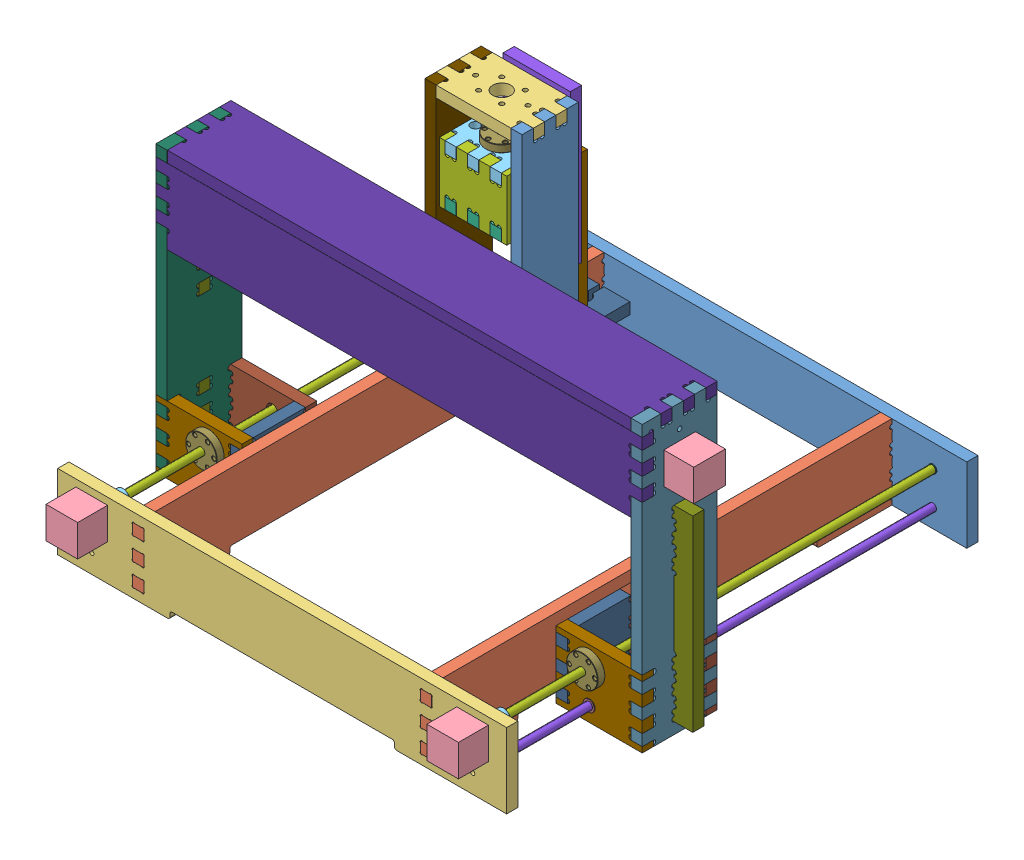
SolidWorks assembly unterbau.SLDASM, configuration Standard (file format 7000). Lengths in mm.
Overall size (715 530.3 670).
54 component instances, 28 part files, 97 mates.
Components (placement in the parent):
- front-1: front.SLDPRT [Standard] at (-265.6288 -95.6832 600) size (600 100 15)
- side-1: side.SLDPRT [Standard] at (-165.5288 -95.6332 1215) x (0 0 -1) z (1 0 0) size (630 100 15)
- side-2: side.SLDPRT [Standard] at (219.2712 -95.6332 1215) x (0 0 -1) z (1 0 0) size (630 100 15)
- back-1: back.SLDPRT [Standard] at (334.3712 -95.6332 1230) x (-1 0 0) z (0 0 -1) size (600 100 15)
- stepper-1: stepper.SLDPRT [Standard] at (310.0212 -47.2832 1270) x (-1 0 0) z (0 0 -1) size (42.3 42.3 64)
- stepper-2: stepper.SLDPRT [Standard] at (-198.9788 -47.2832 1270) x (-1 0 0) z (0 0 -1) size (42.3 42.3 64)
- kupplung-1: kupplung.SLDPRT [Standard] at (288.8712 -26.1332 1188.5) x (0.880226 0.474554 0) z (0 0 1) size (19 19 24.5)
- kupplung-2: kupplung.SLDPRT [Standard] at (-220.1288 -26.1332 1188.5) x (0.966347 -0.257243 0) z (0 0 1) size (19 19 24.5)
- gleitlager_klein-1: gleitlager_klein.SLDPRT [Standard] at (-220.1288 -26.1832 609) x (-0.923728 -0.383049 0) z (0 0 -1) size (11 11 7)
- gleitlager_klein-2: gleitlager_klein.SLDPRT [Standard] at (288.8712 -26.1832 609) x (-0.594495 0.804099 0) z (0 0 -1) size (11 11 7)
- trapezgewinde_unterbau-1: trapezgewinde_unterbau.SLDPRT [Standard] at (288.8712 -26.1832 616) x (0.417755 -0.90856 0) z (0 0 1) size (10 10 584)
- trapezgewinde_unterbau-2: trapezgewinde_unterbau.SLDPRT [Standard] at (-220.1288 -26.1832 616) x (-0.398672 0.917094 0) z (0 0 1) size (10 10 584)
- 10mm_rundstahl_unten-1: 10mm_rundstahl_unten.SLDPRT [Standard] at (-220.1288 -70.6332 607.5) x (0.857233 -0.514928 0) z (0 0 1) size (10 10 615)
- 10mm_rundstahl_unten-2: 10mm_rundstahl_unten.SLDPRT [Standard] at (288.8712 -70.6332 607.5) x (0.207608 -0.978212 0) z (0 0 1) size (10 10 615)
- portal_connection_right-1: portal_connection_right.SLDASM [Standard] at (-234.5996 -50.0916 951.2878) size (115 93.24 111)
  - connection-spindel-1: connection-spindel.SLDPRT [Standard] at (-56.0292 -40.5916 107.5) size (115 90 15)
  - connection-spindel-inner-side-1: connection-spindel-inner-side.SLDPRT [Standard] at (58.9708 -40.6416 22.5) x (0 0 1) z (-1 0 0) size (100 90 15)
  - connection-spindel-front-1: connection-spindel-front.SLDPRT [Standard] at (-56.0292 -40.5916 22.5) size (115 90 15)
  - WFRM_2525TR10x2_1-1: WFRM_2525TR10x2_1.sldasm [Standard] at (14.4708 23.9084 132.5) x (-0.5 -0.866025 0) z (0 0 -1) size (42 42 25)
    - ccLab_20164418254994_0-1: ccLab_20164418254994_0.sldprt [Standard] at (0 0 12.5) size (42 42 25)
  - gleitlager_groß-1: gleitlager_groß.SLDPRT [Standard] at (14.4708 -20.5916 33.5) size (15 15 12)
  - gleitlager_groß-2: gleitlager_groß.SLDPRT [Standard] at (14.4708 -20.5916 111.5) x (-0.923728 -0.383049 0) z (0 0 -1) size (15 15 12)
- portal_connection_left-1: portal_connection_left.SLDASM [Standard] at (303.3419 -50.0916 1181.2878) x (-1 0 0) z (0 0 -1) size (115 90.05 111)
  - connection-spindel-1: connection-spindel.SLDPRT [Standard] at (-56.0292 -40.5916 107.5) size (115 90 15)
  - connection-spindel-inner-side-1: connection-spindel-inner-side.SLDPRT [Standard] at (58.9708 -40.6416 107.5) x (0 0 1) z (-1 0 0) size (100 90 15)
  - connection-spindel-front-1: connection-spindel-front.SLDPRT [Standard] at (-56.0292 -40.5916 192.5) size (115 90 15)
  - WFRM_2525TR10x2_1-1: WFRM_2525TR10x2_1.sldasm [Standard] at (14.4708 23.9084 97.5) size (42 42 25)
    - ccLab_20164418254994_0-1: ccLab_20164418254994_0.sldprt [Standard] at (0 0 12.5) size (42 42 25)
  - gleitlager_groß-1: gleitlager_groß.SLDPRT [Standard] at (14.4708 -20.5916 118.5) size (15 15 12)
  - gleitlager_groß-2: gleitlager_groß.SLDPRT [Standard] at (14.4708 -20.5916 196.5) x (-0.923728 -0.383049 0) z (0 0 -1) size (15 15 12)
- connection-spindel-portal_left-1: connection-spindel-portal_left.SLDPRT [Standard] at (344.3712 -90.7332 1073.7878) x (0 0 -1) z (1 0 0) size (100 380.27 15)
- stepper-3: stepper.SLDPRT [Standard] at (399.3712 203.3873 1002.6378) x (0 0 1) z (-1 0 0) size (42.3 42.3 64)
- kupplung-3: kupplung.SLDPRT [Standard] at (317.8712 224.5373 1023.7878) x (0 0.290446 -0.956891) z (1 0 0) size (19 19 24.5)
- connection-spindel-portal_right-1: connection-spindel-portal_right.SLDPRT [Standard] at (-290.6288 -90.7332 1073.7878) x (0 0 -1) z (1 0 0) size (100 380.27 15)
- gleitlager_groß-1: gleitlager_groß.SLDPRT [Standard] at (-286.6288 224.5374 1023.7878) x (0 0 1) z (-1 0 0) size (15 15 12)
- portal_stiffness_sides-1: portal_stiffness_sides.SLDPRT [Standard] at (-275.6288 -75.6332 1031.3378) x (-1 0 0) z (0 0 -1) size (40 250.45 15)
- portal_stiffness_sides-2: portal_stiffness_sides.SLDPRT [Standard] at (344.3712 -75.6332 1016.2378) size (40 250.45 15)
- portal_quer-3: portal_quer.SLDPRT [Standard] at (-275.6288 289.5374 973.5378) x (1 0 0) z (0 -1 0) size (650 100 15)
- portal_quer-4: portal_quer.SLDPRT [Standard] at (344.3712 274.5374 1058.7878) x (-1 0 0) z (0 0 1) size (650 100 15)
- connection-x-axis-left-1: connection-x-axis-left.SLDPRT [Standard] at (-26.3063 179.5817 948.7612) x (0 -0.000592 1) z (-1 0 0) size (160.5 300 15)
- WFRM_2525TR10x2_1-1: WFRM_2525TR10x2_1.sldasm [Standard] at (-51.3063 224.5373 1023.7878) x (0 -0.924225 -0.381849) z (1 0 0) size (42 42 25)
  - ccLab_20164418254994_0-1: ccLab_20164418254994_0.sldprt [Standard] at (0 0 12.5) size (42 42 25)
- connection-x-axis-right-1: connection-x-axis-right.SLDPRT [Standard] at (88.6937 179.5817 948.7612) x (0 -0.000592 1) z (-1 0 0) size (160.5 300 15)
- connection-x-axis-bottom-1: connection-x-axis-bottom.SLDPRT [Standard] at (-41.3063 179.5715 966.0404) x (1 0 0) z (0 -1 -0.000592) size (130 75.2 15)
- connection-z_axis_motor_upper-1: connection-z_axis_motor_upper.SLDPRT [Standard] at (-26.3063 419.573 963.5325) x (0 -0.000592 1) z (0 1 0.000592) size (75.2 130 15)
- connection-z_axis_motor_bottom-1: connection-z_axis_motor_bottom.SLDPRT [Standard] at (-26.3063 149.6175 888.2727) x (0 0.000592 -1) z (0 -1 -0.000592) size (75.2 130 15)
- connection-z-axis-up_slay-1: connection-z-axis-up_slay.SLDPRT [Standard] at (-21.3063 361.8204 852.5102) x (0 -0.000592 1) z (0 1 0.000592) size (100 90 15)
- WFRM_2525TR10x2_1-2: WFRM_2525TR10x2_1.sldasm [Standard] at (23.6937 386.7768 926.1131) x (0.837288 -0.000324 0.546763) z (0 -1 -0.000592) size (42 42 25)
  - ccLab_20164418254994_0-1: ccLab_20164418254994_0.sldprt [Standard] at (0 0 12.5) size (42 42 25)
- connection-z-axis-bottom_slay-1: connection-z-axis-bottom_slay.SLDPRT [Standard] at (-21.3063 296.8204 852.4717) x (0 -0.000592 1) z (0 1 0.000592) size (100 90 15)
- connection-z-axis-back_slay-1: connection-z-axis-back_slay.SLDPRT [Standard] at (68.6937 311.7632 949.0687) x (0 1 0.000592) z (0 -0.000592 1) size (80 90 15)
- connection-z-axis-front-slay-1: connection-z-axis-front-slay.SLDPRT [Standard] at (-21.3063 226.8136 864.0184) x (1 0 0) z (0 -0.000592 1) size (90 205.25 15)
- to_machine-1: to_machine.SLDPRT [Standard] at (-13.9063 141.8225 848.9681) x (1 0 0) z (0 -0.000592 1) size (75.2 220 15)
- to_dremel-1: to_dremel.SLDPRT [Standard] at (61.3937 126.856 792.225) x (-1 0 0) z (0 0.000592 -1) size (75.3 15 71.73)
Mates (geometry in assembly coordinates):
- Deckungsgleich1: coincident anti-aligned: plane of front-1 through (-265.6288 -95.6832 615) normal (0 0 1); plane of side-2 through (234.2712 -29.0332 615) normal (0 0 -1)
- Deckungsgleich2: coincident anti-aligned: plane of front-1 through (-265.6288 -95.6832 615) normal (0 0 1); plane of side-1 through (-150.5288 -29.0332 615) normal (0 0 -1)
- Deckungsgleich8: coincident anti-aligned: plane of side-1 through (-150.5288 -2.0332 1215) normal (0 0 1); plane of back-1 through (334.3712 -95.6332 1215) normal (0 0 -1)
- Deckungsgleich9: coincident aligned: plane of side-1 through (-150.5288 4.3668 1215) normal (0 1 0); plane of back-1 through (334.3712 4.3668 1215) normal (0 1 0)
- Deckungsgleich11: coincident anti-aligned: plane of back-1 through (334.3712 -95.6332 1230) normal (0 0 1); plane of stepper-2 through (-198.9788 -47.2832 1230) normal (0 0 -1)
- Deckungsgleich12: coincident anti-aligned: plane of back-1 through (334.3712 -95.6332 1230) normal (0 0 1); plane of stepper-1 through (310.0212 -47.2832 1230) normal (0 0 -1)
- Konzentrisch1: concentric aligned: circle of back-1; circle of stepper-1
- Konzentrisch2: concentric aligned: circle of back-1; circle of stepper-1
- Konzentrisch3: concentric aligned: circle of back-1; circle of stepper-2
- Konzentrisch4: concentric aligned: circle of back-1; circle of stepper-2
- Deckungsgleich13: coincident aligned: cylinder of stepper-1 through (288.8712 -26.1332 1206) axis (0 0 1) radius 2.5; circle of kupplung-1
- Deckungsgleich14: coincident anti-aligned: circle of stepper-2; plane of kupplung-2 through (-220.1288 -26.1332 1206) normal (0 0 1)
- Deckungsgleich15: coincident aligned: cylinder of stepper-2 through (-220.1288 -26.1332 1206) axis (0 0 1) radius 2.5; circle of kupplung-2
- Deckungsgleich16: coincident anti-aligned: plane of stepper-1 through (288.8712 -26.1332 1206) normal (0 0 -1); circle of kupplung-1
- Konzentrisch5: concentric anti-aligned: circle of front-1; cylinder of gleitlager_klein-1 through (-220.1288 -26.1832 609) axis (0 0 -1) radius 3.5
- Deckungsgleich17: coincident anti-aligned: plane of front-1 through (-265.6288 -95.6832 615) normal (0 0 1); circle of gleitlager_klein-1
- Konzentrisch6: concentric anti-aligned: cylinder of front-1 through (288.8712 -26.1832 600) axis (0 0 1) radius 3.525; cylinder of gleitlager_klein-2 through (288.8712 -26.1832 609) axis (0 0 -1) radius 3.5
- Deckungsgleich18: coincident anti-aligned: plane of front-1 through (-265.6288 -95.6832 615) normal (0 0 1); circle of gleitlager_klein-2
- Konzentrisch7: concentric aligned: cylinder of gleitlager_klein-2 through (288.8712 -26.1832 609) axis (0 0 -1) radius 2.5; circle of trapezgewinde_unterbau-1
- Deckungsgleich24: coincident anti-aligned: plane of gleitlager_klein-2 through (290.8814 -24.6969 616) normal (0 0 1); plane of trapezgewinde_unterbau-1 through (288.8712 -26.1832 616) normal (0 0 -1)
- Konzentrisch8: concentric anti-aligned: cylinder of gleitlager_klein-1 through (-220.1288 -26.1832 609) axis (0 0 -1) radius 2.5; cylinder of trapezgewinde_unterbau-2 through (-220.1288 -26.1832 609) axis (0 0 1) radius 2.5
- Deckungsgleich25: coincident anti-aligned: plane of gleitlager_klein-1 through (-221.0865 -23.8739 616) normal (0 0 1); plane of trapezgewinde_unterbau-2 through (-220.1288 -26.1832 616) normal (0 0 -1)
- Konzentrisch9: concentric aligned: cylinder of back-1 through (-220.1288 -70.6332 1222.5) axis (0 0 -1) radius 5.025; cylinder of 10mm_rundstahl_unten-1 through (-220.1288 -70.6332 1222.5) axis (0 0 -1) radius 5
- Konzentrisch10: concentric aligned: cylinder of back-1 through (288.8712 -70.6332 1222.5) axis (0 0 -1) radius 5.025; cylinder of 10mm_rundstahl_unten-2 through (288.8712 -70.6332 1222.5) axis (0 0 -1) radius 5
- Deckungsgleich26: coincident anti-aligned: plane of back-1 through (288.8712 -70.6332 1222.5) normal (0 0 -1); plane of 10mm_rundstahl_unten-2 through (288.8712 -70.6332 1222.5) normal (0 0 1)
- Deckungsgleich27: coincident anti-aligned: plane of back-1 through (-220.1288 -70.6332 1222.5) normal (0 0 -1); plane of 10mm_rundstahl_unten-1 through (-220.1288 -70.6332 1222.5) normal (0 0 1)
- Konzentrisch17: concentric anti-aligned: cylinder of trapezgewinde_unterbau-1 through (288.8712 -26.1832 1186) axis (0 0 -1) radius 5; cylinder of portal_connection_left-1/WFRM_2525TR10x2_1-1/ccLab_20164418254994_0-1 through (288.8712 -26.1832 1059.7878) axis (0 0 1) radius 4
- Parallel9: parallel aligned: plane of side-2 through (234.2712 -5.0332 615) normal (1 0 0); plane of portal_connection_left-1/connection-spindel-1 through (359.3712 -53.2332 1058.7878) normal (1 0 0)
- Deckungsgleich30: coincident aligned: cylinder of trapezgewinde_unterbau-2 through (-220.1288 -26.1832 1186) axis (0 0 -1) radius 5; circle of portal_connection_right-1/WFRM_2525TR10x2_1-1/ccLab_20164418254994_0-1
- Parallel10: parallel aligned: plane of side-1 through (-165.5288 -5.0332 615) normal (-1 0 0); plane of portal_connection_right-1/connection-spindel-inner-side-1 through (-190.6288 -5.1332 988.7878) normal (-1 0 0)
- Deckungsgleich33: coincident aligned: plane of portal_connection_right-1/connection-spindel-front-1 through (-190.6288 -80.3332 973.7878) normal (0 0 -1); plane of portal_connection_left-1/connection-spindel-front-1 through (259.3712 -80.3332 973.7878) normal (0 0 -1)
- Deckungsgleich37: coincident anti-aligned: plane of portal_connection_left-1/connection-spindel-1 through (344.3712 -14.0332 1058.7878) normal (1 0 0); plane of connection-spindel-portal_left-1 through (344.3712 -4.3832 1058.7878) normal (-1 0 0)
- Abstand7: distance = 0.05 mm aligned: plane of portal_connection_left-1/connection-spindel-front-1 through (359.3712 -90.6832 973.7878) normal (0 -1 0); plane of connection-spindel-portal_left-1 through (359.3712 -90.7332 988.7878) normal (0 -1 0)
- Deckungsgleich39: coincident anti-aligned: plane of portal_connection_left-1/connection-spindel-front-1 through (259.3712 -80.3332 988.7878) normal (0 0 1); plane of connection-spindel-portal_left-1 through (359.3712 -29.1332 988.7878) normal (0 0 -1)
- Deckungsgleich43: coincident anti-aligned: plane of connection-spindel-portal_left-1 through (359.3712 -4.3832 1058.7878) normal (1 0 0); plane of stepper-3 through (359.3712 203.3873 1002.6378) normal (-1 0 0)
- Konzentrisch20: concentric anti-aligned: cylinder of connection-spindel-portal_left-1 through (361.8712 224.5373 1023.7878) axis (-1 0 0) radius 12; cylinder of stepper-3 through (335.3712 224.5373 1023.7878) axis (1 0 0) radius 2.5
- Konzentrisch21: concentric aligned: cylinder of connection-spindel-portal_left-1 through (361.8712 240.0373 1008.2878) axis (-1 0 0) radius 3; circle of stepper-3
- Konzentrisch22: concentric anti-aligned: cylinder of stepper-3 through (335.3712 224.5373 1023.7878) axis (1 0 0) radius 2.5; cylinder of kupplung-3 through (324.8712 224.5373 1023.7878) axis (-1 0 0) radius 2.5
- Abstand9: distance = 7 mm anti-aligned: plane of stepper-3 through (335.3712 224.5373 1023.7878) normal (-1 0 0); plane of kupplung-3 through (342.3712 224.5373 1023.7878) normal (1 0 0)
- Deckungsgleich44: coincident aligned: plane of portal_connection_right-1/connection-spindel-front-1 through (-290.6288 -23.1332 988.7878) normal (-1 0 0); plane of connection-spindel-portal_right-1 through (-290.6288 -4.3832 1058.7878) normal (-1 0 0)
- Abstand10: distance = 0.05 mm aligned: plane of portal_connection_right-1/connection-spindel-front-1 through (-290.6288 -90.6832 988.7878) normal (0 -1 0); plane of connection-spindel-portal_right-1 through (-275.6288 -90.7332 988.7878) normal (0 -1 0)
- Deckungsgleich46: coincident aligned: plane of portal_connection_right-1/connection-spindel-front-1 through (-190.6288 -80.3332 973.7878) normal (0 0 -1); plane of connection-spindel-portal_right-1 through (-275.6288 -0.6332 973.7878) normal (0 0 -1)
- Deckungsgleich48: coincident anti-aligned: plane of front-1 through (-265.6288 -95.6832 615) normal (0 0 1); plane of side-1 through (-150.5288 -29.0332 615) normal (0 0 -1)
- Deckungsgleich49: coincident anti-aligned: plane of front-1 through (-150.5288 -20.1332 600) normal (-1 0 0); plane of side-1 through (-150.5288 -5.0332 615) normal (1 0 0)
- Abstand11: distance = 0.05 mm aligned: plane of front-1 through (-265.6288 4.3168 615) normal (0 1 0); plane of side-1 through (-150.5288 4.3668 1215) normal (0 1 0)
- Deckungsgleich50: coincident anti-aligned: plane of side-1 through (-150.5288 -5.0332 615) normal (1 0 0); plane of back-1 through (-150.5288 -95.6332 1230) normal (-1 0 0)
- Abstand12: distance = 0.05 mm aligned: plane of side-2 through (234.2712 4.3668 1215) normal (0 1 0); plane of front-1 through (-265.6288 4.3168 615) normal (0 1 0)
- Deckungsgleich52: coincident anti-aligned: plane of front-1 through (219.2712 -95.6832 600) normal (1 0 0); plane of side-2 through (219.2712 -5.0332 615) normal (-1 0 0)
- Konzentrisch23: concentric anti-aligned: cylinder of connection-spindel-portal_right-1 through (-293.1288 224.5374 1023.7878) axis (1 0 0) radius 6.05; cylinder of gleitlager_groß-1 through (-286.6288 224.5374 1023.7878) axis (-1 0 0) radius 6
- Deckungsgleich53: coincident anti-aligned: plane of connection-spindel-portal_right-1 through (-275.6288 -4.3832 1058.7878) normal (1 0 0); plane of gleitlager_groß-1 through (-275.6288 232.0374 1023.7878) normal (-1 0 0)
- Deckungsgleich60: coincident anti-aligned: plane of connection-spindel-portal_right-1 through (-290.6288 -4.3832 1058.7878) normal (-1 0 0); plane of portal_stiffness_sides-1 through (-290.6288 93.6168 1016.3378) normal (1 0 0)
- Abstand14: distance = 0.05 mm anti-aligned: plane of connection-spindel-portal_right-1 through (-293.1288 174.8668 1073.7878) normal (0 -1 0); plane of portal_stiffness_sides-1 through (-275.6288 174.8168 1016.3378) normal (0 1 0)
- Deckungsgleich62: coincident anti-aligned: plane of connection-spindel-portal_right-1 through (-293.1288 -90.7332 1031.3378) normal (0 0 -1); plane of portal_stiffness_sides-1 through (-290.6288 96.6168 1031.3378) normal (0 0 1)
- Deckungsgleich63: coincident anti-aligned: plane of connection-spindel-portal_left-1 through (341.8712 -90.7332 1016.2378) normal (0 0 1); plane of portal_stiffness_sides-2 through (359.3712 96.6168 1016.2378) normal (0 0 -1)
- Abstand13: distance = 0.05 mm anti-aligned: plane of connection-spindel-portal_left-1 through (341.8712 174.8668 1073.7878) normal (0 -1 0); plane of portal_stiffness_sides-2 through (344.3712 174.8168 1031.2378) normal (0 1 0)
- Deckungsgleich65: coincident anti-aligned: plane of connection-spindel-portal_left-1 through (359.3712 -4.3832 1058.7878) normal (1 0 0); plane of portal_stiffness_sides-2 through (359.3712 93.6168 1031.2378) normal (-1 0 0)
- Deckungsgleich66: coincident aligned: plane of connection-spindel-portal_left-1 through (359.3712 289.5374 1003.5878) normal (0 1 0); plane of portal_quer-3 through (-275.6288 289.5374 991.5378) normal (0 1 0)
- Deckungsgleich67: coincident anti-aligned: plane of connection-spindel-portal_left-1 through (344.3712 -4.3832 1058.7878) normal (-1 0 0); plane of portal_quer-3 through (344.3712 274.5374 997.6378) normal (1 0 0)
- Abstand16: distance = 0.05 mm anti-aligned: plane of connection-spindel-portal_left-1 through (359.3712 289.5374 988.5878) normal (0 0 -1); plane of portal_quer-3 through (359.3712 274.5374 988.5378) normal (0 0 1)
- Deckungsgleich70: coincident anti-aligned: plane of portal_quer-3 through (-275.6288 274.5374 991.5378) normal (0 -1 0); plane of portal_quer-4 through (-275.6288 274.5374 1073.7878) normal (0 1 0)
- Deckungsgleich71: coincident anti-aligned: plane of connection-spindel-portal_left-1 through (344.3712 -4.3832 1058.7878) normal (-1 0 0); plane of portal_quer-4 through (344.3712 174.5374 1073.7878) normal (1 0 0)
- Deckungsgleich72: coincident anti-aligned: plane of connection-spindel-portal_right-1 through (-275.6288 235.3374 1058.7878) normal (0 0 1); plane of portal_quer-4 through (344.3712 256.5374 1058.7878) normal (0 0 -1)
- Deckungsgleich73: coincident anti-aligned: plane of connection-x-axis-left-1 through (-41.3063 149.5837 945.4227) normal (-1 0 0); plane of WFRM_2525TR10x2_1-1/ccLab_20164418254994_0-1 through (-41.3063 209.2876 1017.4873) normal (1 0 0)
- Konzentrisch26: concentric aligned: cylinder of connection-x-axis-left-1 through (-26.3063 224.5373 1023.7878) axis (-1 0 0) radius 12.55; cylinder of WFRM_2525TR10x2_1-1/ccLab_20164418254994_0-1 through (-34.0563 224.5373 1023.7878) axis (-1 0 0) radius 12.5
- Konzentrisch27: concentric anti-aligned: cylinder of kupplung-3 through (342.3712 224.5373 1023.7878) axis (-1 0 0) radius 9.5; circle of WFRM_2525TR10x2_1-1/ccLab_20164418254994_0-1
- Konzentrisch28: concentric aligned: cylinder of connection-spindel-portal_left-1 through (351.8712 259.5373 1023.7878) axis (-1 0 0) radius 5.05; cylinder of connection-x-axis-left-1 through (-26.3063 259.5373 1023.7878) axis (-1 0 0) radius 6.05
- Konzentrisch29: concentric anti-aligned: circle of WFRM_2525TR10x2_1-1/ccLab_20164418254994_0-1; cylinder of connection-x-axis-right-1 through (88.6937 224.5373 1023.7878) axis (-1 0 0) radius 7.5
- Konzentrisch30: concentric aligned: circle of connection-x-axis-left-1; cylinder of connection-x-axis-right-1 through (88.6937 189.5373 1023.7671) axis (-1 0 0) radius 6.05
- Deckungsgleich90: coincident anti-aligned: plane of connection-x-axis-right-1 through (73.6937 179.5225 1048.8093) normal (0 -1 -0.000592); plane of connection-x-axis-bottom-1 through (-26.3063 179.5333 1030.6404) normal (0 1 0.000592)
- Deckungsgleich91: coincident anti-aligned: plane of connection-x-axis-left-1 through (-41.3063 179.5315 1033.6404) normal (0 -0.000592 1); plane of connection-x-axis-bottom-1 through (88.6937 164.5315 1033.6315) normal (0 0.000592 -1)
- Deckungsgleich92: coincident anti-aligned: plane of connection-x-axis-right-1 through (73.6937 149.5836 945.4916) normal (-1 0 0); plane of connection-x-axis-bottom-1 through (73.6937 164.535 1027.6316) normal (1 0 0)
- Deckungsgleich93: coincident anti-aligned: plane of connection-x-axis-left-1 through (-26.3063 149.5837 945.4227) normal (1 0 0); plane of connection-x-axis-bottom-1 through (-26.3063 164.535 1027.6316) normal (-1 0 0)
- Abstand20: distance = 0.05 mm anti-aligned: plane of connection-x-axis-left-1 through (-41.3063 134.5819 948.4138) normal (0 0.000592 -1); plane of connection-z_axis_motor_bottom-1 through (-26.3063 134.5819 948.3638) normal (0 -0.000592 1)
- Deckungsgleich97: coincident anti-aligned: plane of connection-x-axis-right-1 through (73.6937 149.5836 945.4916) normal (-1 0 0); plane of connection-z_axis_motor_bottom-1 through (73.6937 134.5962 924.2638) normal (1 0 0)
- Deckungsgleich98: coincident anti-aligned: plane of connection-x-axis-right-1 through (73.6937 149.6032 912.3916) normal (0 -1 -0.000592); plane of connection-z_axis_motor_bottom-1 through (-26.3063 149.6104 900.2727) normal (0 1 0.000592)
- Deckungsgleich99: coincident anti-aligned: plane of connection-x-axis-left-1 through (-41.3063 419.6051 909.3825) normal (0 1 0.000592); plane of connection-z_axis_motor_upper-1 through (-26.3063 419.5801 951.5325) normal (0 -1 -0.000592)
- Abstand21: distance = 0.05 mm anti-aligned: plane of connection-x-axis-left-1 through (-41.3063 419.5819 948.5825) normal (0 0.000592 -1); plane of connection-z_axis_motor_upper-1 through (-41.3063 434.5819 948.5414) normal (0 -0.000592 1)
- Deckungsgleich101: coincident: plane of connection-x-axis-right-1 through (73.6937 149.5836 945.4916) normal (-1 0 0); line of connection-z_axis_motor_upper-1 through (73.6937 434.5943 927.5414) axis (0 -1 -0.000592)
- Konzentrisch31: concentric aligned: cylinder of connection-z_axis_motor_bottom-1 through (58.6937 142.0952 925.9683) axis (0 1 0.000592) radius 5.05; cylinder of connection-z-axis-up_slay-1 through (58.6937 361.7768 926.0983) axis (0 1 0.000592) radius 6.05
- Konzentrisch32: concentric aligned: cylinder of connection-z_axis_motor_bottom-1 through (23.6937 132.0952 925.9623) axis (0 1 0.000592) radius 3.55; cylinder of connection-z-axis-up_slay-1 through (23.6937 361.7768 926.0983) axis (0 1 0.000592) radius 12.55
- Konzentrisch33: concentric aligned: cylinder of connection-z-axis-up_slay-1 through (23.6937 361.7768 926.0983) axis (0 1 0.000592) radius 12.55; cylinder of WFRM_2525TR10x2_1-2/ccLab_20164418254994_0-1 through (23.6937 369.5268 926.1029) axis (0 1 0.000592) radius 12.5
- Deckungsgleich102: coincident anti-aligned: plane of connection-z-axis-up_slay-1 through (13.1937 376.7632 949.1071) normal (0 1 0.000592); plane of WFRM_2525TR10x2_1-2/ccLab_20164418254994_0-1 through (37.509 376.7715 935.1287) normal (0 -1 -0.000592)
- Konzentrisch40: concentric aligned: cylinder of WFRM_2525TR10x2_1-2/ccLab_20164418254994_0-1 through (23.6937 362.7768 926.0989) axis (0 1 0.000592) radius 4; cylinder of connection-z-axis-bottom_slay-1 through (23.6937 296.7769 926.0598) axis (0 1 0.000592) radius 7
- Konzentrisch41: concentric aligned: cylinder of connection-z-axis-up_slay-1 through (58.6937 361.7768 926.0983) axis (0 1 0.000592) radius 6.05; cylinder of connection-z-axis-bottom_slay-1 through (58.6937 296.7769 926.0598) axis (0 1 0.000592) radius 6.05
- Deckungsgleich104: coincident anti-aligned: plane of connection-z-axis-bottom_slay-1 through (13.1937 311.7632 949.0687) normal (0 1 0.000592); plane of connection-z-axis-back_slay-1 through (22.1437 311.7544 964.0687) normal (0 -1 -0.000592)
- Deckungsgleich105: coincident anti-aligned: plane of connection-z-axis-up_slay-1 through (13.1937 361.7632 949.0983) normal (0 -1 -0.000592); plane of connection-z-axis-back_slay-1 through (25.2437 361.7544 964.0983) normal (0 1 0.000592)
- Abstand22: distance = 0.05 mm anti-aligned: plane of connection-z-axis-bottom_slay-1 through (46.2937 311.7632 949.0687) normal (-1 0 0); plane of connection-z-axis-back_slay-1 through (46.2437 296.7544 964.0598) normal (1 0 0)
- Deckungsgleich107: coincident anti-aligned: plane of connection-z-axis-up_slay-1 through (10.1937 376.7632 949.1071) normal (0 -0.000592 1); plane of connection-z-axis-back_slay-1 through (58.3437 361.7632 949.0983) normal (0 0.000592 -1)
- Abstand23: distance = 0.05 mm anti-aligned: plane of connection-z-axis-front-slay-1 through (61.3437 377.0547 879.1073) normal (-1 0 0); plane of connection-z-axis-up_slay-1 through (61.2937 376.8135 864.1072) normal (1 0 0)
- Deckungsgleich109: coincident anti-aligned: plane of connection-z-axis-up_slay-1 through (40.2937 376.8047 879.1072) normal (0 0.000592 -1); plane of connection-z-axis-front-slay-1 through (-21.3063 226.8047 879.0184) normal (0 -0.000592 1)
- Deckungsgleich110: coincident anti-aligned: plane of connection-z-axis-bottom_slay-1 through (13.1937 296.7632 949.0598) normal (0 -1 -0.000592); plane of connection-z-axis-front-slay-1 through (22.1437 296.8047 879.0598) normal (0 1 0.000592)
- Konzentrisch42: concentric aligned: cylinder of connection-z-axis-front-slay-1 through (-1.3063 336.8047 879.0835) axis (0 0.000592 -1) radius 4.75; cylinder of to_machine-1 through (-1.3063 336.8135 864.0835) axis (0 0.000592 -1) radius 4.5
- Konzentrisch43: concentric aligned: cylinder of connection-z-axis-front-slay-1 through (48.6937 256.8047 879.0361) axis (0 0.000592 -1) radius 4.75; cylinder of to_machine-1 through (48.6937 256.8136 864.0361) axis (0 0.000592 -1) radius 4.5
- Deckungsgleich111: coincident anti-aligned: plane of connection-z-axis-front-slay-1 through (-21.3063 226.8136 864.0184) normal (0 0.000592 -1); plane of to_machine-1 through (4.0937 141.8136 863.9681) normal (0 -0.000592 1)
- Deckungsgleich112: coincident anti-aligned: plane of to_machine-1 through (7.0937 141.8136 863.9681) normal (0 -1 -0.000592); plane of to_dremel-1 through (49.2937 141.8225 848.9681) normal (0 1 0.000592)
- Deckungsgleich113: coincident anti-aligned: plane of to_machine-1 through (46.2937 141.8136 863.9681) normal (-1 0 0); plane of to_dremel-1 through (46.2937 141.8225 848.9681) normal (1 0 0)
- Deckungsgleich115: coincident anti-aligned: plane of to_machine-1 through (4.0937 141.8225 848.9681) normal (0 0.000592 -1); plane of to_dremel-1 through (25.2937 141.8225 848.9681) normal (0 -0.000592 1)
